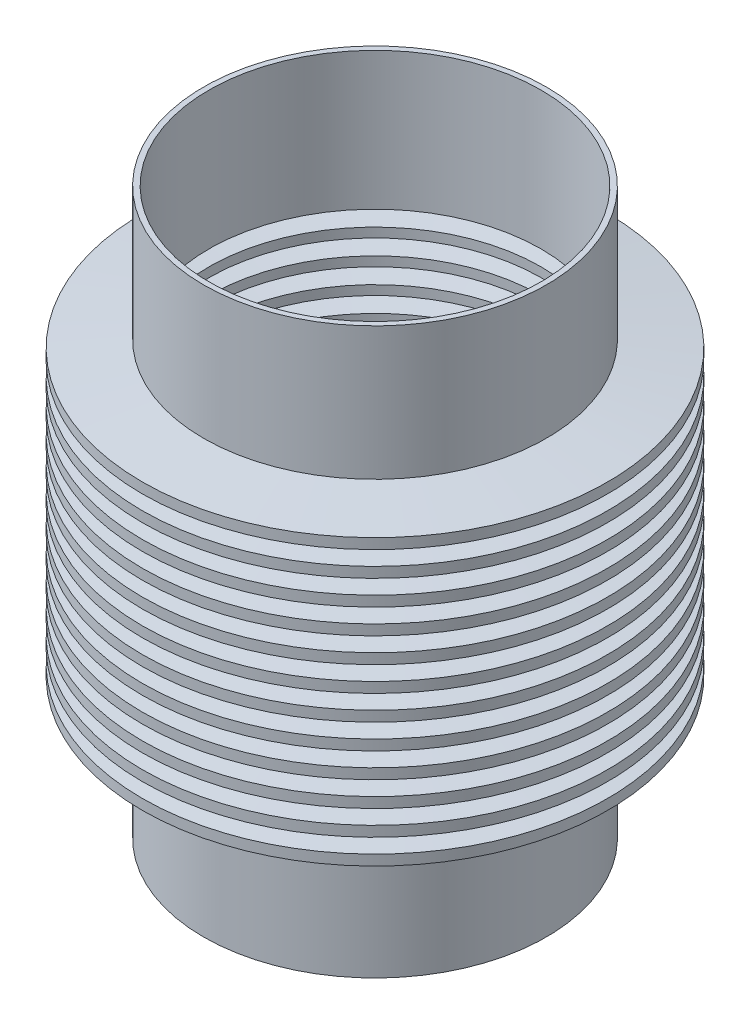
from build123d import *


with BuildPart() as part:
    # Sketch1 → Revolve1 (revolve)
    with BuildSketch(Plane.XY, mode=Mode.PRIVATE) as revolve1_sk:
        Polygon((-32.766, 0), (-31.75, 0), (-31.75, 26.302246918), (-44.176548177, 27.78125), (-31.75, 29.260253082), (-31.75, 31.064746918), (-44.176548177, 32.54375), (-31.75, 34.022753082), (-31.75, 35.827246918), (-44.176548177, 37.30625), (-31.75, 38.785253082), (-31.75, 40.589746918), (-44.176548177, 42.06875), (-31.75, 43.547753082), (-31.75, 45.352246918), (-44.176548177, 46.83125), (-31.75, 48.310253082), (-31.75, 50.114746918), (-44.176548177, 51.59375), (-31.75, 53.072753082), (-31.75, 54.877246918), (-44.176548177, 56.35625), (-31.75, 57.835253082), (-31.75, 59.639746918), (-44.176548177, 61.11875), (-31.75, 62.597753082), (-31.75, 64.402246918), (-44.176548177, 65.88125), (-31.75, 67.360253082), (-31.75, 69.164746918), (-44.176548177, 70.64375), (-31.75, 72.122753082), (-31.75, 73.927246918), (-44.176548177, 75.40625), (-31.75, 76.885253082), (-31.75, 78.689746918), (-44.176548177, 80.16875), (-31.75, 81.647753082), (-31.75, 107.95), (-32.766, 107.95), (-32.766, 82.55), (-44.45, 81.159374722), (-44.45, 79.178125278), (-32.766, 77.7875), (-44.45, 76.396874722), (-44.45, 74.415625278), (-32.766, 73.025), (-44.45, 71.634374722), (-44.45, 69.653125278), (-32.766, 68.2625), (-44.45, 66.871874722), (-44.45, 64.890625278), (-32.766, 63.5), (-44.45, 62.109374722), (-44.45, 60.128125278), (-32.766, 58.7375), (-44.45, 57.346874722), (-44.45, 55.365625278), (-32.766, 53.975), (-44.45, 52.584374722), (-44.45, 50.603125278), (-32.766, 49.2125), (-44.45, 47.821874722), (-44.45, 45.840625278), (-32.766, 44.45), (-44.45, 43.059374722), (-44.45, 41.078125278), (-32.766, 39.6875), (-44.45, 38.296874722), (-44.45, 36.315625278), (-32.766, 34.925), (-44.45, 33.534374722), (-44.45, 31.553125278), (-32.766, 30.1625), (-44.45, 28.771874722), (-44.45, 26.790625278), (-32.766, 25.4), align=None)
    revolve(revolve1_sk.sketch.rotate(Axis((0, 0, 0), (0, 1, 0)), 270), axis=Axis((0, 0, 0), (0, 1, 0)))


solid = part.part
